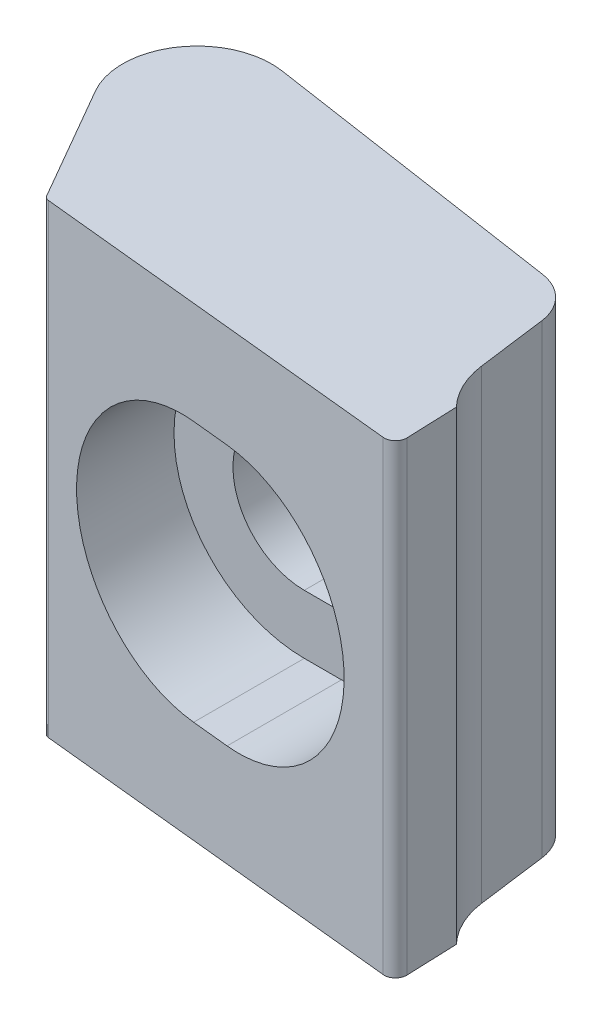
ISO-10303-21;
HEADER;
FILE_DESCRIPTION(('STEP AP214'),'2;1');
FILE_NAME('part.step','',(''),(''),'','','');
FILE_SCHEMA(('AUTOMOTIVE_DESIGN { 1 0 10303 214 1 1 1 1 }'));
ENDSEC;
DATA;
#1=APPLICATION_CONTEXT('core data for automotive mechanical design processes');
#2=APPLICATION_PROTOCOL_DEFINITION('international standard','automotive_design',2000,#1);
#3=PRODUCT_CONTEXT('',#1,'mechanical');
#4=PRODUCT('Part','Part','',(#3));
#5=PRODUCT_RELATED_PRODUCT_CATEGORY('part','',(#4));
#6=PRODUCT_DEFINITION_FORMATION('','',#4);
#7=PRODUCT_DEFINITION_CONTEXT('part definition',#1,'design');
#8=PRODUCT_DEFINITION('design','',#6,#7);
#9=PRODUCT_DEFINITION_SHAPE('','',#8);
#10=(LENGTH_UNIT() NAMED_UNIT(*) SI_UNIT(.MILLI.,.METRE.));
#11=(NAMED_UNIT(*) PLANE_ANGLE_UNIT() SI_UNIT($,.RADIAN.));
#12=(NAMED_UNIT(*) SI_UNIT($,.STERADIAN.) SOLID_ANGLE_UNIT());
#13=UNCERTAINTY_MEASURE_WITH_UNIT(LENGTH_MEASURE(1.E-05),#10,'distance_accuracy_value','');
#14=(GEOMETRIC_REPRESENTATION_CONTEXT(3) GLOBAL_UNCERTAINTY_ASSIGNED_CONTEXT((#13)) GLOBAL_UNIT_ASSIGNED_CONTEXT((#10,
#11,#12)) REPRESENTATION_CONTEXT('',''));
#15=CARTESIAN_POINT('',(0.,0.,0.));
#16=DIRECTION('',(0.,0.,1.));
#17=DIRECTION('',(1.,0.,0.));
#18=AXIS2_PLACEMENT_3D('',#15,#16,#17);
#19=CARTESIAN_POINT('',(5.06222,4.7625,2.97434));
#20=DIRECTION('',(0.,-1.,0.));
#21=DIRECTION('',(1.,0.,0.));
#22=AXIS2_PLACEMENT_3D('',#19,#20,#21);
#23=CYLINDRICAL_SURFACE('',#22,1.778);
#24=CARTESIAN_POINT('',(5.06222,-4.7625,2.97434));
#25=DIRECTION('',(0.,-1.,0.));
#26=DIRECTION('',(-1.,0.,0.));
#27=AXIS2_PLACEMENT_3D('',#24,#25,#26);
#28=CIRCLE('',#27,1.778);
#29=CARTESIAN_POINT('',(3.76941791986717,-4.7625,4.19497376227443));
#30=VERTEX_POINT('',#29);
#31=CARTESIAN_POINT('',(3.29928842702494,-4.7625,3.20532975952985));
#32=VERTEX_POINT('',#31);
#33=EDGE_CURVE('E191',#30,#32,#28,.T.);
#34=ORIENTED_EDGE('',*,*,#33,.T.);
#35=DIRECTION('',(0.,-1.,0.));
#36=VECTOR('',#35,1.);
#37=CARTESIAN_POINT('',(3.29928842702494,4.7625,3.20532975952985));
#38=LINE('',#37,#36);
#39=CARTESIAN_POINT('',(3.29928842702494,4.7625,3.20532975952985));
#40=VERTEX_POINT('',#39);
#41=EDGE_CURVE('E267',#40,#32,#38,.T.);
#42=ORIENTED_EDGE('',*,*,#41,.F.);
#43=CARTESIAN_POINT('',(5.06222,4.7625,2.97434));
#44=DIRECTION('',(0.,-1.,0.));
#45=DIRECTION('',(-1.,0.,0.));
#46=AXIS2_PLACEMENT_3D('',#43,#44,#45);
#47=CIRCLE('',#46,1.778);
#48=CARTESIAN_POINT('',(3.76941791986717,4.7625,4.19497376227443));
#49=VERTEX_POINT('',#48);
#50=EDGE_CURVE('E219',#49,#40,#47,.T.);
#51=ORIENTED_EDGE('',*,*,#50,.F.);
#52=DIRECTION('',(0.,-1.,0.));
#53=VECTOR('',#52,1.);
#54=CARTESIAN_POINT('',(3.76941791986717,4.7625,4.19497376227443));
#55=LINE('',#54,#53);
#56=EDGE_CURVE('E240',#49,#30,#55,.T.);
#57=ORIENTED_EDGE('',*,*,#56,.T.);
#58=EDGE_LOOP('',(#34,#42,#51,#57));
#59=FACE_BOUND('',#58,.T.);
#60=ADVANCED_FACE('F14',(#59),#23,.F.);
#61=CARTESIAN_POINT('',(3.29928842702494,4.7625,3.20532975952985));
#62=DIRECTION('',(-0.991525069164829,0.,0.129915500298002));
#63=DIRECTION('',(0.129915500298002,0.,0.991525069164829));
#64=AXIS2_PLACEMENT_3D('',#61,#62,#63);
#65=PLANE('',#64);
#66=DIRECTION('',(-0.129915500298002,0.,-0.99152506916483));
#67=VECTOR('',#66,1.);
#68=CARTESIAN_POINT('',(3.29928842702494,-4.7625,3.20532975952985));
#69=LINE('',#68,#67);
#70=CARTESIAN_POINT('',(3.1134799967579,-4.7625,1.78722555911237));
#71=VERTEX_POINT('',#70);
#72=EDGE_CURVE('E201',#32,#71,#69,.T.);
#73=ORIENTED_EDGE('',*,*,#72,.T.);
#74=DIRECTION('',(0.,-1.,0.));
#75=VECTOR('',#74,1.);
#76=CARTESIAN_POINT('',(3.1134799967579,4.7625,1.78722555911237));
#77=LINE('',#76,#75);
#78=CARTESIAN_POINT('',(3.1134799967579,4.7625,1.78722555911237));
#79=VERTEX_POINT('',#78);
#80=EDGE_CURVE('E264',#79,#71,#77,.T.);
#81=ORIENTED_EDGE('',*,*,#80,.F.);
#82=DIRECTION('',(-0.129915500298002,0.,-0.99152506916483));
#83=VECTOR('',#82,1.);
#84=CARTESIAN_POINT('',(3.29928842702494,4.7625,3.20532975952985));
#85=LINE('',#84,#83);
#86=EDGE_CURVE('E222',#40,#79,#85,.T.);
#87=ORIENTED_EDGE('',*,*,#86,.F.);
#88=ORIENTED_EDGE('',*,*,#41,.T.);
#89=EDGE_LOOP('',(#73,#81,#87,#88));
#90=FACE_BOUND('',#89,.T.);
#91=ADVANCED_FACE('F305',(#90),#65,.F.);
#92=CARTESIAN_POINT('',(2.15646,4.7625,1.91262));
#93=DIRECTION('',(0.,-1.,0.));
#94=DIRECTION('',(1.,0.,0.));
#95=AXIS2_PLACEMENT_3D('',#92,#93,#94);
#96=CYLINDRICAL_SURFACE('',#95,0.9652);
#97=CARTESIAN_POINT('',(2.15646,-4.7625,1.91262));
#98=DIRECTION('',(0.,1.,0.));
#99=DIRECTION('',(-1.,0.,0.));
#100=AXIS2_PLACEMENT_3D('',#97,#98,#99);
#101=CIRCLE('',#100,0.9652);
#102=CARTESIAN_POINT('',(2.29947259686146,-4.7625,0.958073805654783));
#103=VERTEX_POINT('',#102);
#104=EDGE_CURVE('E203',#71,#103,#101,.T.);
#105=ORIENTED_EDGE('',*,*,#104,.T.);
#106=DIRECTION('',(0.,-1.,0.));
#107=VECTOR('',#106,1.);
#108=CARTESIAN_POINT('',(2.29947259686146,4.7625,0.958073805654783));
#109=LINE('',#108,#107);
#110=CARTESIAN_POINT('',(2.29947259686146,4.7625,0.958073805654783));
#111=VERTEX_POINT('',#110);
#112=EDGE_CURVE('E261',#111,#103,#109,.T.);
#113=ORIENTED_EDGE('',*,*,#112,.F.);
#114=CARTESIAN_POINT('',(2.15646,4.7625,1.91262));
#115=DIRECTION('',(0.,1.,0.));
#116=DIRECTION('',(-1.,0.,0.));
#117=AXIS2_PLACEMENT_3D('',#114,#115,#116);
#118=CIRCLE('',#117,0.9652);
#119=EDGE_CURVE('E224',#79,#111,#118,.T.);
#120=ORIENTED_EDGE('',*,*,#119,.F.);
#121=ORIENTED_EDGE('',*,*,#80,.T.);
#122=EDGE_LOOP('',(#105,#113,#120,#121));
#123=FACE_BOUND('',#122,.T.);
#124=ADVANCED_FACE('F311',(#123),#96,.T.);
#125=CARTESIAN_POINT('',(-3.98297063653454,4.7625,0.016821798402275));
#126=DIRECTION('',(-0.148168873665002,0.,0.988962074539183));
#127=DIRECTION('',(0.988962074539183,0.,0.148168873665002));
#128=AXIS2_PLACEMENT_3D('',#125,#126,#127);
#129=PLANE('',#128);
#130=DIRECTION('',(-0.988962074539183,0.,-0.148168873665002));
#131=VECTOR('',#130,1.);
#132=CARTESIAN_POINT('',(-3.98297063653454,1.4605,0.016821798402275));
#133=LINE('',#132,#131);
#134=CARTESIAN_POINT('',(0.,1.4605,0.613560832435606));
#135=VERTEX_POINT('',#134);
#136=CARTESIAN_POINT('',(-0.762,1.4605,0.499396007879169));
#137=VERTEX_POINT('',#136);
#138=EDGE_CURVE('E169',#135,#137,#133,.T.);
#139=ORIENTED_EDGE('',*,*,#138,.T.);
#140=CARTESIAN_POINT('',(-0.762,0.,0.499396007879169));
#141=DIRECTION('',(-0.148168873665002,0.,0.988962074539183));
#142=DIRECTION('',(0.988962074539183,0.,0.148168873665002));
#143=AXIS2_PLACEMENT_3D('',#140,#141,#142);
#144=ELLIPSE('',#143,1.4768008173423,1.4605);
#145=CARTESIAN_POINT('',(-0.762,-1.4605,0.499396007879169));
#146=VERTEX_POINT('',#145);
#147=EDGE_CURVE('E172',#137,#146,#144,.T.);
#148=ORIENTED_EDGE('',*,*,#147,.T.);
#149=DIRECTION('',(0.988962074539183,0.,0.148168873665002));
#150=VECTOR('',#149,1.);
#151=CARTESIAN_POINT('',(-3.98297063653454,-1.4605,0.016821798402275));
#152=LINE('',#151,#150);
#153=CARTESIAN_POINT('',(0.,-1.4605,0.613560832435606));
#154=VERTEX_POINT('',#153);
#155=EDGE_CURVE('E164',#146,#154,#152,.T.);
#156=ORIENTED_EDGE('',*,*,#155,.T.);
#157=CARTESIAN_POINT('',(0.,0.,0.613560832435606));
#158=DIRECTION('',(-0.148168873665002,0.,0.988962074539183));
#159=DIRECTION('',(0.988962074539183,0.,0.148168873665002));
#160=AXIS2_PLACEMENT_3D('',#157,#158,#159);
#161=ELLIPSE('',#160,1.4768008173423,1.4605);
#162=EDGE_CURVE('E144',#154,#135,#161,.T.);
#163=ORIENTED_EDGE('',*,*,#162,.T.);
#164=EDGE_LOOP('',(#139,#148,#156,#163));
#165=FACE_BOUND('',#164,.T.);
#166=DIRECTION('',(-0.988962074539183,0.,-0.148168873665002));
#167=VECTOR('',#166,1.);
#168=CARTESIAN_POINT('',(-3.98297063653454,-4.7625,0.016821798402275));
#169=LINE('',#168,#167);
#170=CARTESIAN_POINT('',(-3.98297063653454,-4.7625,0.016821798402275));
#171=VERTEX_POINT('',#170);
#172=EDGE_CURVE('E205',#103,#171,#169,.T.);
#173=ORIENTED_EDGE('',*,*,#172,.T.);
#174=DIRECTION('',(0.,-1.,0.));
#175=VECTOR('',#174,1.);
#176=CARTESIAN_POINT('',(-3.98297063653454,4.7625,0.016821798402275));
#177=LINE('',#176,#175);
#178=CARTESIAN_POINT('',(-3.98297063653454,4.7625,0.016821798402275));
#179=VERTEX_POINT('',#178);
#180=EDGE_CURVE('E258',#179,#171,#177,.T.);
#181=ORIENTED_EDGE('',*,*,#180,.F.);
#182=DIRECTION('',(-0.988962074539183,0.,-0.148168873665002));
#183=VECTOR('',#182,1.);
#184=CARTESIAN_POINT('',(-3.98297063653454,4.7625,0.016821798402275));
#185=LINE('',#184,#183);
#186=EDGE_CURVE('E226',#111,#179,#185,.T.);
#187=ORIENTED_EDGE('',*,*,#186,.F.);
#188=ORIENTED_EDGE('',*,*,#112,.T.);
#189=EDGE_LOOP('',(#173,#181,#187,#188));
#190=FACE_BOUND('',#189,.T.);
#191=ADVANCED_FACE('F355',(#165,#190),#129,.F.);
#192=CARTESIAN_POINT('',(-4.20878,4.7625,1.524));
#193=DIRECTION('',(0.,-1.,0.));
#194=DIRECTION('',(1.,0.,0.));
#195=AXIS2_PLACEMENT_3D('',#192,#193,#194);
#196=CYLINDRICAL_SURFACE('',#195,1.524);
#197=CARTESIAN_POINT('',(-4.20878,-4.7625,1.524));
#198=DIRECTION('',(0.,1.,0.));
#199=DIRECTION('',(-1.,0.,0.));
#200=AXIS2_PLACEMENT_3D('',#197,#198,#199);
#201=CIRCLE('',#200,1.524);
#202=CARTESIAN_POINT('',(-5.52889030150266,-4.7625,2.28550166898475));
#203=VERTEX_POINT('',#202);
#204=EDGE_CURVE('E207',#171,#203,#201,.T.);
#205=ORIENTED_EDGE('',*,*,#204,.T.);
#206=DIRECTION('',(0.,-1.,0.));
#207=VECTOR('',#206,1.);
#208=CARTESIAN_POINT('',(-5.52889030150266,4.7625,2.28550166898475));
#209=LINE('',#208,#207);
#210=CARTESIAN_POINT('',(-5.52889030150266,4.7625,2.28550166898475));
#211=VERTEX_POINT('',#210);
#212=EDGE_CURVE('E255',#211,#203,#209,.T.);
#213=ORIENTED_EDGE('',*,*,#212,.F.);
#214=CARTESIAN_POINT('',(-4.20878,4.7625,1.524));
#215=DIRECTION('',(0.,1.,0.));
#216=DIRECTION('',(-1.,0.,0.));
#217=AXIS2_PLACEMENT_3D('',#214,#215,#216);
#218=CIRCLE('',#217,1.524);
#219=EDGE_CURVE('E228',#179,#211,#218,.T.);
#220=ORIENTED_EDGE('',*,*,#219,.F.);
#221=ORIENTED_EDGE('',*,*,#180,.T.);
#222=EDGE_LOOP('',(#205,#213,#220,#221));
#223=FACE_BOUND('',#222,.T.);
#224=ADVANCED_FACE('F350',(#223),#196,.T.);
#225=CARTESIAN_POINT('',(-4.16892919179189,4.7625,4.64307847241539));
#226=DIRECTION('',(0.866214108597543,0.,-0.499673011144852));
#227=DIRECTION('',(-0.499673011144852,0.,-0.866214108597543));
#228=AXIS2_PLACEMENT_3D('',#225,#226,#227);
#229=PLANE('',#228);
#230=DIRECTION('',(0.499673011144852,0.,0.866214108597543));
#231=VECTOR('',#230,1.);
#232=CARTESIAN_POINT('',(-4.16892919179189,-4.7625,4.64307847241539));
#233=LINE('',#232,#231);
#234=CARTESIAN_POINT('',(-4.16892919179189,-4.7625,4.64307847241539));
#235=VERTEX_POINT('',#234);
#236=EDGE_CURVE('E209',#203,#235,#233,.T.);
#237=ORIENTED_EDGE('',*,*,#236,.T.);
#238=DIRECTION('',(0.,-1.,0.));
#239=VECTOR('',#238,1.);
#240=CARTESIAN_POINT('',(-4.16892919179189,4.7625,4.64307847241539));
#241=LINE('',#240,#239);
#242=CARTESIAN_POINT('',(-4.16892919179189,4.7625,4.64307847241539));
#243=VERTEX_POINT('',#242);
#244=EDGE_CURVE('E252',#243,#235,#241,.T.);
#245=ORIENTED_EDGE('',*,*,#244,.F.);
#246=DIRECTION('',(0.499673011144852,0.,0.866214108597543));
#247=VECTOR('',#246,1.);
#248=CARTESIAN_POINT('',(-4.16892919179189,4.7625,4.64307847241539));
#249=LINE('',#248,#247);
#250=EDGE_CURVE('E230',#211,#243,#249,.T.);
#251=ORIENTED_EDGE('',*,*,#250,.F.);
#252=ORIENTED_EDGE('',*,*,#212,.T.);
#253=EDGE_LOOP('',(#237,#245,#251,#252));
#254=FACE_BOUND('',#253,.T.);
#255=ADVANCED_FACE('F346',(#254),#229,.F.);
#256=CARTESIAN_POINT('',(-4.05892,4.7625,4.57962));
#257=DIRECTION('',(0.,-1.,0.));
#258=DIRECTION('',(1.,0.,0.));
#259=AXIS2_PLACEMENT_3D('',#256,#257,#258);
#260=CYLINDRICAL_SURFACE('',#259,0.127);
#261=CARTESIAN_POINT('',(-4.05892,-4.7625,4.57962));
#262=DIRECTION('',(0.,1.,0.));
#263=DIRECTION('',(-1.,0.,0.));
#264=AXIS2_PLACEMENT_3D('',#261,#262,#263);
#265=CIRCLE('',#264,0.127);
#266=CARTESIAN_POINT('',(-4.07174017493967,-4.7625,4.70597126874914));
#267=VERTEX_POINT('',#266);
#268=EDGE_CURVE('E211',#235,#267,#265,.T.);
#269=ORIENTED_EDGE('',*,*,#268,.T.);
#270=DIRECTION('',(0.,-1.,0.));
#271=VECTOR('',#270,1.);
#272=CARTESIAN_POINT('',(-4.07174017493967,4.7625,4.70597126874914));
#273=LINE('',#272,#271);
#274=CARTESIAN_POINT('',(-4.07174017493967,4.7625,4.70597126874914));
#275=VERTEX_POINT('',#274);
#276=EDGE_CURVE('E249',#275,#267,#273,.T.);
#277=ORIENTED_EDGE('',*,*,#276,.F.);
#278=CARTESIAN_POINT('',(-4.05892,4.7625,4.57962));
#279=DIRECTION('',(0.,1.,0.));
#280=DIRECTION('',(-1.,0.,0.));
#281=AXIS2_PLACEMENT_3D('',#278,#279,#280);
#282=CIRCLE('',#281,0.127);
#283=EDGE_CURVE('E232',#243,#275,#282,.T.);
#284=ORIENTED_EDGE('',*,*,#283,.F.);
#285=ORIENTED_EDGE('',*,*,#244,.T.);
#286=EDGE_LOOP('',(#269,#277,#284,#285));
#287=FACE_BOUND('',#286,.T.);
#288=ADVANCED_FACE('F342',(#287),#260,.T.);
#289=CARTESIAN_POINT('',(3.55832368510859,4.7625,5.48015228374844));
#290=DIRECTION('',(0.100946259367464,0.,-0.994891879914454));
#291=DIRECTION('',(-0.994891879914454,0.,-0.100946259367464));
#292=AXIS2_PLACEMENT_3D('',#289,#290,#291);
#293=PLANE('',#292);
#294=DIRECTION('',(0.994891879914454,0.,0.100946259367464));
#295=VECTOR('',#294,1.);
#296=CARTESIAN_POINT('',(3.55832368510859,2.667,5.48015228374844));
#297=LINE('',#296,#295);
#298=CARTESIAN_POINT('',(-0.762,2.667,5.04179257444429));
#299=VERTEX_POINT('',#298);
#300=CARTESIAN_POINT('',(0.,2.667,5.11910856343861));
#301=VERTEX_POINT('',#300);
#302=EDGE_CURVE('E270',#299,#301,#297,.T.);
#303=ORIENTED_EDGE('',*,*,#302,.T.);
#304=CARTESIAN_POINT('',(0.,0.,5.11910856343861));
#305=DIRECTION('',(0.100946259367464,0.,-0.994891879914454));
#306=DIRECTION('',(0.994891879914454,0.,0.100946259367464));
#307=AXIS2_PLACEMENT_3D('',#304,#305,#306);
#308=ELLIPSE('',#307,2.68069330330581,2.667);
#309=CARTESIAN_POINT('',(0.,-2.667,5.11910856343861));
#310=VERTEX_POINT('',#309);
#311=EDGE_CURVE('E9',#301,#310,#308,.T.);
#312=ORIENTED_EDGE('',*,*,#311,.T.);
#313=DIRECTION('',(-0.994891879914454,0.,-0.100946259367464));
#314=VECTOR('',#313,1.);
#315=CARTESIAN_POINT('',(3.55832368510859,-2.667,5.48015228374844));
#316=LINE('',#315,#314);
#317=CARTESIAN_POINT('',(-0.762,-2.667,5.04179257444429));
#318=VERTEX_POINT('',#317);
#319=EDGE_CURVE('E21',#310,#318,#316,.T.);
#320=ORIENTED_EDGE('',*,*,#319,.T.);
#321=CARTESIAN_POINT('',(-0.762,0.,5.04179257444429));
#322=DIRECTION('',(0.100946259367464,0.,-0.994891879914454));
#323=DIRECTION('',(0.994891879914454,0.,0.100946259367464));
#324=AXIS2_PLACEMENT_3D('',#321,#322,#323);
#325=ELLIPSE('',#324,2.68069330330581,2.667);
#326=EDGE_CURVE('E273',#318,#299,#325,.T.);
#327=ORIENTED_EDGE('',*,*,#326,.T.);
#328=EDGE_LOOP('',(#303,#312,#320,#327));
#329=FACE_BOUND('',#328,.T.);
#330=DIRECTION('',(0.994891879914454,0.,0.100946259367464));
#331=VECTOR('',#330,1.);
#332=CARTESIAN_POINT('',(3.55832368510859,-4.7625,5.48015228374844));
#333=LINE('',#332,#331);
#334=CARTESIAN_POINT('',(3.55832368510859,-4.7625,5.48015228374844));
#335=VERTEX_POINT('',#334);
#336=EDGE_CURVE('E213',#267,#335,#333,.T.);
#337=ORIENTED_EDGE('',*,*,#336,.T.);
#338=DIRECTION('',(0.,-1.,0.));
#339=VECTOR('',#338,1.);
#340=CARTESIAN_POINT('',(3.55832368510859,4.7625,5.48015228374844));
#341=LINE('',#340,#339);
#342=CARTESIAN_POINT('',(3.55832368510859,4.7625,5.48015228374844));
#343=VERTEX_POINT('',#342);
#344=EDGE_CURVE('E246',#343,#335,#341,.T.);
#345=ORIENTED_EDGE('',*,*,#344,.F.);
#346=DIRECTION('',(0.994891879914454,0.,0.100946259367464));
#347=VECTOR('',#346,1.);
#348=CARTESIAN_POINT('',(3.55832368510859,4.7625,5.48015228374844));
#349=LINE('',#348,#347);
#350=EDGE_CURVE('E234',#275,#343,#349,.T.);
#351=ORIENTED_EDGE('',*,*,#350,.F.);
#352=ORIENTED_EDGE('',*,*,#276,.T.);
#353=EDGE_LOOP('',(#337,#345,#351,#352));
#354=FACE_BOUND('',#353,.T.);
#355=ADVANCED_FACE('F277',(#329,#354),#293,.F.);
#356=CARTESIAN_POINT('',(3.5814,4.7625,5.25272));
#357=DIRECTION('',(0.,-1.,0.));
#358=DIRECTION('',(1.,0.,0.));
#359=AXIS2_PLACEMENT_3D('',#356,#357,#358);
#360=CYLINDRICAL_SURFACE('',#359,0.2286);
#361=CARTESIAN_POINT('',(3.5814,-4.7625,5.25272));
#362=DIRECTION('',(0.,1.,0.));
#363=DIRECTION('',(-1.,0.,0.));
#364=AXIS2_PLACEMENT_3D('',#361,#362,#363);
#365=CIRCLE('',#364,0.2286);
#366=CARTESIAN_POINT('',(3.80983053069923,-4.7625,5.24391928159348));
#367=VERTEX_POINT('',#366);
#368=EDGE_CURVE('E215',#335,#367,#365,.T.);
#369=ORIENTED_EDGE('',*,*,#368,.T.);
#370=DIRECTION('',(0.,-1.,0.));
#371=VECTOR('',#370,1.);
#372=CARTESIAN_POINT('',(3.80983053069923,4.7625,5.24391928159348));
#373=LINE('',#372,#371);
#374=CARTESIAN_POINT('',(3.80983053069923,4.7625,5.24391928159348));
#375=VERTEX_POINT('',#374);
#376=EDGE_CURVE('E243',#375,#367,#373,.T.);
#377=ORIENTED_EDGE('',*,*,#376,.F.);
#378=CARTESIAN_POINT('',(3.5814,4.7625,5.25272));
#379=DIRECTION('',(0.,1.,0.));
#380=DIRECTION('',(-1.,0.,0.));
#381=AXIS2_PLACEMENT_3D('',#378,#379,#380);
#382=CIRCLE('',#381,0.2286);
#383=EDGE_CURVE('E236',#343,#375,#382,.T.);
#384=ORIENTED_EDGE('',*,*,#383,.F.);
#385=ORIENTED_EDGE('',*,*,#344,.T.);
#386=EDGE_LOOP('',(#369,#377,#384,#385));
#387=FACE_BOUND('',#386,.T.);
#388=ADVANCED_FACE('F333',(#387),#360,.T.);
#389=CARTESIAN_POINT('',(3.80983053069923,4.7625,5.24391928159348));
#390=DIRECTION('',(-0.999258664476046,0.,0.0384983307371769));
#391=DIRECTION('',(0.0384983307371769,0.,0.999258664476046));
#392=AXIS2_PLACEMENT_3D('',#389,#390,#391);
#393=PLANE('',#392);
#394=DIRECTION('',(-0.0384983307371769,0.,-0.999258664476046));
#395=VECTOR('',#394,1.);
#396=CARTESIAN_POINT('',(3.80983053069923,-4.7625,5.24391928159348));
#397=LINE('',#396,#395);
#398=EDGE_CURVE('E217',#367,#30,#397,.T.);
#399=ORIENTED_EDGE('',*,*,#398,.T.);
#400=ORIENTED_EDGE('',*,*,#56,.F.);
#401=DIRECTION('',(-0.0384983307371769,0.,-0.999258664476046));
#402=VECTOR('',#401,1.);
#403=CARTESIAN_POINT('',(3.80983053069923,4.7625,5.24391928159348));
#404=LINE('',#403,#402);
#405=EDGE_CURVE('E238',#375,#49,#404,.T.);
#406=ORIENTED_EDGE('',*,*,#405,.F.);
#407=ORIENTED_EDGE('',*,*,#376,.T.);
#408=EDGE_LOOP('',(#399,#400,#406,#407));
#409=FACE_BOUND('',#408,.T.);
#410=ADVANCED_FACE('F331',(#409),#393,.F.);
#411=CARTESIAN_POINT('',(5.06222,4.7625,2.97434));
#412=DIRECTION('',(0.,1.,0.));
#413=DIRECTION('',(-1.,0.,0.));
#414=AXIS2_PLACEMENT_3D('',#411,#412,#413);
#415=PLANE('',#414);
#416=ORIENTED_EDGE('',*,*,#50,.T.);
#417=ORIENTED_EDGE('',*,*,#86,.T.);
#418=ORIENTED_EDGE('',*,*,#119,.T.);
#419=ORIENTED_EDGE('',*,*,#186,.T.);
#420=ORIENTED_EDGE('',*,*,#219,.T.);
#421=ORIENTED_EDGE('',*,*,#250,.T.);
#422=ORIENTED_EDGE('',*,*,#283,.T.);
#423=ORIENTED_EDGE('',*,*,#350,.T.);
#424=ORIENTED_EDGE('',*,*,#383,.T.);
#425=ORIENTED_EDGE('',*,*,#405,.T.);
#426=EDGE_LOOP('',(#416,#417,#418,#419,#420,#421,#422,#423,#424,#425));
#427=FACE_BOUND('',#426,.T.);
#428=ADVANCED_FACE('F326',(#427),#415,.T.);
#429=CARTESIAN_POINT('',(5.06222,-4.7625,2.97434));
#430=DIRECTION('',(0.,1.,0.));
#431=DIRECTION('',(-1.,0.,0.));
#432=AXIS2_PLACEMENT_3D('',#429,#430,#431);
#433=PLANE('',#432);
#434=ORIENTED_EDGE('',*,*,#33,.F.);
#435=ORIENTED_EDGE('',*,*,#398,.F.);
#436=ORIENTED_EDGE('',*,*,#368,.F.);
#437=ORIENTED_EDGE('',*,*,#336,.F.);
#438=ORIENTED_EDGE('',*,*,#268,.F.);
#439=ORIENTED_EDGE('',*,*,#236,.F.);
#440=ORIENTED_EDGE('',*,*,#204,.F.);
#441=ORIENTED_EDGE('',*,*,#172,.F.);
#442=ORIENTED_EDGE('',*,*,#104,.F.);
#443=ORIENTED_EDGE('',*,*,#72,.F.);
#444=EDGE_LOOP('',(#434,#435,#436,#437,#438,#439,#440,#441,#442,#443));
#445=FACE_BOUND('',#444,.T.);
#446=ADVANCED_FACE('F319',(#445),#433,.F.);
#447=CARTESIAN_POINT('',(0.,0.,2.77622));
#448=DIRECTION('',(0.,0.,1.));
#449=DIRECTION('',(0.,1.,0.));
#450=AXIS2_PLACEMENT_3D('',#447,#448,#449);
#451=CYLINDRICAL_SURFACE('',#450,2.667);
#452=DIRECTION('',(0.,0.,1.));
#453=VECTOR('',#452,1.);
#454=CARTESIAN_POINT('',(0.,2.667,2.77622));
#455=LINE('',#454,#453);
#456=CARTESIAN_POINT('',(0.,2.667,2.77622));
#457=VERTEX_POINT('',#456);
#458=EDGE_CURVE('E187',#457,#301,#455,.T.);
#459=ORIENTED_EDGE('',*,*,#458,.F.);
#460=CARTESIAN_POINT('',(0.,0.,2.77622));
#461=DIRECTION('',(0.,0.,1.));
#462=DIRECTION('',(0.,1.,0.));
#463=AXIS2_PLACEMENT_3D('',#460,#461,#462);
#464=CIRCLE('',#463,2.667);
#465=CARTESIAN_POINT('',(0.,-2.667,2.77622));
#466=VERTEX_POINT('',#465);
#467=EDGE_CURVE('E175',#466,#457,#464,.T.);
#468=ORIENTED_EDGE('',*,*,#467,.F.);
#469=DIRECTION('',(0.,0.,1.));
#470=VECTOR('',#469,1.);
#471=CARTESIAN_POINT('',(0.,-2.667,2.77622));
#472=LINE('',#471,#470);
#473=EDGE_CURVE('E188',#466,#310,#472,.T.);
#474=ORIENTED_EDGE('',*,*,#473,.T.);
#475=ORIENTED_EDGE('',*,*,#311,.F.);
#476=EDGE_LOOP('',(#459,#468,#474,#475));
#477=FACE_BOUND('',#476,.T.);
#478=ADVANCED_FACE('F285',(#477),#451,.F.);
#479=CARTESIAN_POINT('',(0.,-2.667,2.77622));
#480=DIRECTION('',(0.,-1.,0.));
#481=DIRECTION('',(1.,0.,0.));
#482=AXIS2_PLACEMENT_3D('',#479,#480,#481);
#483=PLANE('',#482);
#484=ORIENTED_EDGE('',*,*,#473,.F.);
#485=DIRECTION('',(1.,0.,0.));
#486=VECTOR('',#485,1.);
#487=CARTESIAN_POINT('',(0.,-2.667,2.77622));
#488=LINE('',#487,#486);
#489=CARTESIAN_POINT('',(-0.762,-2.667,2.77622));
#490=VERTEX_POINT('',#489);
#491=EDGE_CURVE('E184',#490,#466,#488,.T.);
#492=ORIENTED_EDGE('',*,*,#491,.F.);
#493=DIRECTION('',(0.,0.,1.));
#494=VECTOR('',#493,1.);
#495=CARTESIAN_POINT('',(-0.762,-2.667,2.77622));
#496=LINE('',#495,#494);
#497=EDGE_CURVE('E192',#490,#318,#496,.T.);
#498=ORIENTED_EDGE('',*,*,#497,.T.);
#499=ORIENTED_EDGE('',*,*,#319,.F.);
#500=EDGE_LOOP('',(#484,#492,#498,#499));
#501=FACE_BOUND('',#500,.T.);
#502=ADVANCED_FACE('F281',(#501),#483,.F.);
#503=CARTESIAN_POINT('',(-0.762,0.,2.77622));
#504=DIRECTION('',(0.,0.,1.));
#505=DIRECTION('',(0.,1.,0.));
#506=AXIS2_PLACEMENT_3D('',#503,#504,#505);
#507=CYLINDRICAL_SURFACE('',#506,2.667);
#508=ORIENTED_EDGE('',*,*,#497,.F.);
#509=CARTESIAN_POINT('',(-0.762,0.,2.77622));
#510=DIRECTION('',(0.,0.,1.));
#511=DIRECTION('',(0.,1.,0.));
#512=AXIS2_PLACEMENT_3D('',#509,#510,#511);
#513=CIRCLE('',#512,2.667);
#514=CARTESIAN_POINT('',(-0.762,2.667,2.77622));
#515=VERTEX_POINT('',#514);
#516=EDGE_CURVE('E181',#515,#490,#513,.T.);
#517=ORIENTED_EDGE('',*,*,#516,.F.);
#518=DIRECTION('',(0.,0.,1.));
#519=VECTOR('',#518,1.);
#520=CARTESIAN_POINT('',(-0.762,2.667,2.77622));
#521=LINE('',#520,#519);
#522=EDGE_CURVE('E195',#515,#299,#521,.T.);
#523=ORIENTED_EDGE('',*,*,#522,.T.);
#524=ORIENTED_EDGE('',*,*,#326,.F.);
#525=EDGE_LOOP('',(#508,#517,#523,#524));
#526=FACE_BOUND('',#525,.T.);
#527=ADVANCED_FACE('F289',(#526),#507,.F.);
#528=CARTESIAN_POINT('',(0.,2.667,2.77622));
#529=DIRECTION('',(0.,1.,0.));
#530=DIRECTION('',(-1.,0.,0.));
#531=AXIS2_PLACEMENT_3D('',#528,#529,#530);
#532=PLANE('',#531);
#533=ORIENTED_EDGE('',*,*,#522,.F.);
#534=DIRECTION('',(-1.,0.,0.));
#535=VECTOR('',#534,1.);
#536=CARTESIAN_POINT('',(0.,2.667,2.77622));
#537=LINE('',#536,#535);
#538=EDGE_CURVE('E178',#457,#515,#537,.T.);
#539=ORIENTED_EDGE('',*,*,#538,.F.);
#540=ORIENTED_EDGE('',*,*,#458,.T.);
#541=ORIENTED_EDGE('',*,*,#302,.F.);
#542=EDGE_LOOP('',(#533,#539,#540,#541));
#543=FACE_BOUND('',#542,.T.);
#544=ADVANCED_FACE('F291',(#543),#532,.F.);
#545=CARTESIAN_POINT('',(0.,0.,2.77622));
#546=DIRECTION('',(0.,0.,1.));
#547=DIRECTION('',(0.,1.,0.));
#548=AXIS2_PLACEMENT_3D('',#545,#546,#547);
#549=PLANE('',#548);
#550=CARTESIAN_POINT('',(-0.762,0.,2.77622));
#551=DIRECTION('',(0.,0.,1.));
#552=DIRECTION('',(0.,1.,0.));
#553=AXIS2_PLACEMENT_3D('',#550,#551,#552);
#554=CIRCLE('',#553,1.4605);
#555=CARTESIAN_POINT('',(-0.762,1.4605,2.77622));
#556=VERTEX_POINT('',#555);
#557=CARTESIAN_POINT('',(-0.762,-1.4605,2.77622));
#558=VERTEX_POINT('',#557);
#559=EDGE_CURVE('E36',#556,#558,#554,.T.);
#560=ORIENTED_EDGE('',*,*,#559,.F.);
#561=DIRECTION('',(-1.,0.,0.));
#562=VECTOR('',#561,1.);
#563=CARTESIAN_POINT('',(0.,1.4605,2.77622));
#564=LINE('',#563,#562);
#565=CARTESIAN_POINT('',(0.,1.4605,2.77622));
#566=VERTEX_POINT('',#565);
#567=EDGE_CURVE('E157',#566,#556,#564,.T.);
#568=ORIENTED_EDGE('',*,*,#567,.F.);
#569=CARTESIAN_POINT('',(0.,0.,2.77622));
#570=DIRECTION('',(0.,0.,1.));
#571=DIRECTION('',(0.,1.,0.));
#572=AXIS2_PLACEMENT_3D('',#569,#570,#571);
#573=CIRCLE('',#572,1.4605);
#574=CARTESIAN_POINT('',(0.,-1.4605,2.77622));
#575=VERTEX_POINT('',#574);
#576=EDGE_CURVE('E141',#575,#566,#573,.T.);
#577=ORIENTED_EDGE('',*,*,#576,.F.);
#578=DIRECTION('',(1.,0.,0.));
#579=VECTOR('',#578,1.);
#580=CARTESIAN_POINT('',(-0.762,-1.4605,2.77622));
#581=LINE('',#580,#579);
#582=EDGE_CURVE('E150',#558,#575,#581,.T.);
#583=ORIENTED_EDGE('',*,*,#582,.F.);
#584=EDGE_LOOP('',(#560,#568,#577,#583));
#585=FACE_BOUND('',#584,.T.);
#586=ORIENTED_EDGE('',*,*,#467,.T.);
#587=ORIENTED_EDGE('',*,*,#538,.T.);
#588=ORIENTED_EDGE('',*,*,#516,.T.);
#589=ORIENTED_EDGE('',*,*,#491,.T.);
#590=EDGE_LOOP('',(#586,#587,#588,#589));
#591=FACE_BOUND('',#590,.T.);
#592=ADVANCED_FACE('F154',(#585,#591),#549,.T.);
#593=CARTESIAN_POINT('',(-0.762,0.,0.));
#594=DIRECTION('',(0.,0.,1.));
#595=DIRECTION('',(0.,1.,0.));
#596=AXIS2_PLACEMENT_3D('',#593,#594,#595);
#597=CYLINDRICAL_SURFACE('',#596,1.4605);
#598=DIRECTION('',(0.,0.,1.));
#599=VECTOR('',#598,1.);
#600=CARTESIAN_POINT('',(-0.762,1.4605,0.));
#601=LINE('',#600,#599);
#602=EDGE_CURVE('E162',#137,#556,#601,.T.);
#603=ORIENTED_EDGE('',*,*,#602,.T.);
#604=ORIENTED_EDGE('',*,*,#559,.T.);
#605=DIRECTION('',(0.,0.,1.));
#606=VECTOR('',#605,1.);
#607=CARTESIAN_POINT('',(-0.762,-1.4605,0.));
#608=LINE('',#607,#606);
#609=EDGE_CURVE('E147',#146,#558,#608,.T.);
#610=ORIENTED_EDGE('',*,*,#609,.F.);
#611=ORIENTED_EDGE('',*,*,#147,.F.);
#612=EDGE_LOOP('',(#603,#604,#610,#611));
#613=FACE_BOUND('',#612,.T.);
#614=ADVANCED_FACE('F300',(#613),#597,.F.);
#615=CARTESIAN_POINT('',(0.,1.4605,0.));
#616=DIRECTION('',(0.,1.,0.));
#617=DIRECTION('',(-1.,0.,0.));
#618=AXIS2_PLACEMENT_3D('',#615,#616,#617);
#619=PLANE('',#618);
#620=DIRECTION('',(0.,0.,1.));
#621=VECTOR('',#620,1.);
#622=CARTESIAN_POINT('',(0.,1.4605,0.));
#623=LINE('',#622,#621);
#624=EDGE_CURVE('E146',#135,#566,#623,.T.);
#625=ORIENTED_EDGE('',*,*,#624,.T.);
#626=ORIENTED_EDGE('',*,*,#567,.T.);
#627=ORIENTED_EDGE('',*,*,#602,.F.);
#628=ORIENTED_EDGE('',*,*,#138,.F.);
#629=EDGE_LOOP('',(#625,#626,#627,#628));
#630=FACE_BOUND('',#629,.T.);
#631=ADVANCED_FACE('F394',(#630),#619,.F.);
#632=CARTESIAN_POINT('',(0.,0.,0.));
#633=DIRECTION('',(0.,0.,1.));
#634=DIRECTION('',(0.,1.,0.));
#635=AXIS2_PLACEMENT_3D('',#632,#633,#634);
#636=CYLINDRICAL_SURFACE('',#635,1.4605);
#637=DIRECTION('',(0.,0.,1.));
#638=VECTOR('',#637,1.);
#639=CARTESIAN_POINT('',(0.,-1.4605,0.));
#640=LINE('',#639,#638);
#641=EDGE_CURVE('E28',#154,#575,#640,.T.);
#642=ORIENTED_EDGE('',*,*,#641,.T.);
#643=ORIENTED_EDGE('',*,*,#576,.T.);
#644=ORIENTED_EDGE('',*,*,#624,.F.);
#645=ORIENTED_EDGE('',*,*,#162,.F.);
#646=EDGE_LOOP('',(#642,#643,#644,#645));
#647=FACE_BOUND('',#646,.T.);
#648=ADVANCED_FACE('F138',(#647),#636,.F.);
#649=CARTESIAN_POINT('',(-0.762,-1.4605,0.));
#650=DIRECTION('',(0.,-1.,0.));
#651=DIRECTION('',(1.,0.,0.));
#652=AXIS2_PLACEMENT_3D('',#649,#650,#651);
#653=PLANE('',#652);
#654=ORIENTED_EDGE('',*,*,#609,.T.);
#655=ORIENTED_EDGE('',*,*,#582,.T.);
#656=ORIENTED_EDGE('',*,*,#641,.F.);
#657=ORIENTED_EDGE('',*,*,#155,.F.);
#658=EDGE_LOOP('',(#654,#655,#656,#657));
#659=FACE_BOUND('',#658,.T.);
#660=ADVANCED_FACE('F151',(#659),#653,.F.);
#661=CLOSED_SHELL('',(#60,#91,#124,#191,#224,#255,#288,#355,#388,#410,#428,#446,#478,#502,#527,
#544,#592,#614,#631,#648,#660));
#662=MANIFOLD_SOLID_BREP('B1',#661);
#663=ADVANCED_BREP_SHAPE_REPRESENTATION('',(#18,#662),#14);
#664=SHAPE_DEFINITION_REPRESENTATION(#9,#663);
ENDSEC;
END-ISO-10303-21;
